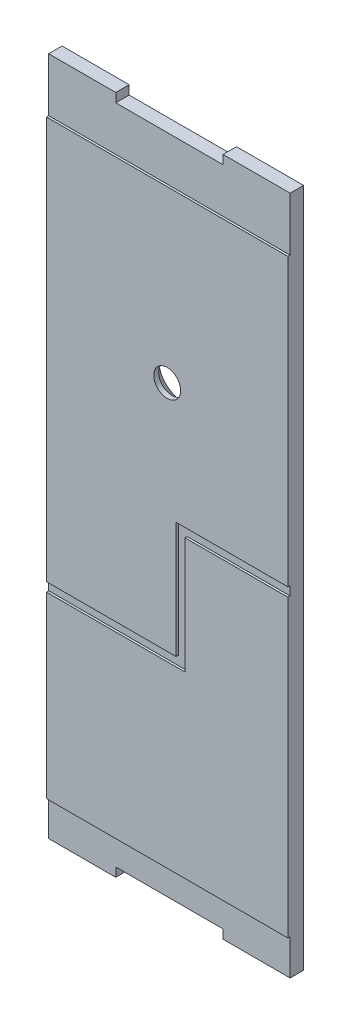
from build123d import *

# Parameters (mm, degrees)
SKETCH_1_W          = 27
SKETCH_1_H          = 76
EXTRUDE_1_DEPTH     = 1.5
SKETCH_3_W          = 27
SKETCH_3_H          = 76
EXTRUDE_2_DEPTH     = 0.25
SKETCH_5_W          = 27
SKETCH_5_H          = 6
SKETCH_5_H_2        = 4
CUT_EXTRUDE_1_DEPTH = 0.25
SKETCH_6_R          = 1.5
CUT_EXTRUDE_2_DEPTH = 81.67256349
CUT_EXTRUDE_3_DEPTH = 0.25
SKETCH_8_W          = 12
SKETCH_8_H          = 1
CUT_EXTRUDE_4_DEPTH = 81.667527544
CHAMFER_1_SIZE      = 1.2


with BuildPart() as part:
    # Sketch 1 → Extrude 1 (new body)
    with BuildSketch(Plane.XY):
        with Locations((13.5, 38)):
            Rectangle(SKETCH_1_W, SKETCH_1_H)
    extrude(amount=EXTRUDE_1_DEPTH)

    # Sketch 3 → Extrude 2 (add)
    with BuildSketch(Plane.XY.offset(1.5)):
        with Locations((13.5, 38)):
            Rectangle(SKETCH_3_W, SKETCH_3_H)
    extrude(amount=EXTRUDE_2_DEPTH)

    # Sketch 5 → Cut-Extrude 1 (cut)
    with BuildSketch(Plane.XY.offset(1.75)):
        with Locations((13.5, 73)):
            Rectangle(SKETCH_5_W, SKETCH_5_H)
        with Locations((13.5, 2)):
            Rectangle(SKETCH_5_W, SKETCH_5_H_2)
    extrude(amount=-CUT_EXTRUDE_1_DEPTH, mode=Mode.SUBTRACT)

    # Sketch 6 → Cut-Extrude 2 (cut, through all)
    with BuildSketch(Plane.XY.offset(1.75)):
        with Locations((13.5, 51)):
            Circle(SKETCH_6_R)
    extrude(amount=-CUT_EXTRUDE_2_DEPTH, mode=Mode.SUBTRACT)

    # Sketch 7 → Cut-Extrude 3 (cut)
    with BuildSketch(Plane.XY.offset(1.75)):
        Polygon((14.5, 38), (27, 38), (27, 37), (15.5, 37), (15.5, 24), (0, 24), (0, 25), (12.5, 25), (14.5, 25), align=None)
    extrude(amount=-CUT_EXTRUDE_3_DEPTH, mode=Mode.SUBTRACT)

    # Sketch 8 → Cut-Extrude 4 (cut, through all)
    with BuildSketch(Plane.XY.offset(1.5)):
        with Locations((13.5, 75.5)):
            Rectangle(SKETCH_8_W, SKETCH_8_H)
        with Locations((13.5, 0.5)):
            Rectangle(SKETCH_8_W, SKETCH_8_H)
    extrude(amount=-CUT_EXTRUDE_4_DEPTH, mode=Mode.SUBTRACT)

    # Chamfer 1
    chamfer_1_edges = [part.edges().sort_by_distance(p)[0] for p in [
        (12, 51, 0),
    ]]
    chamfer(chamfer_1_edges, length=CHAMFER_1_SIZE)


solid = part.part
